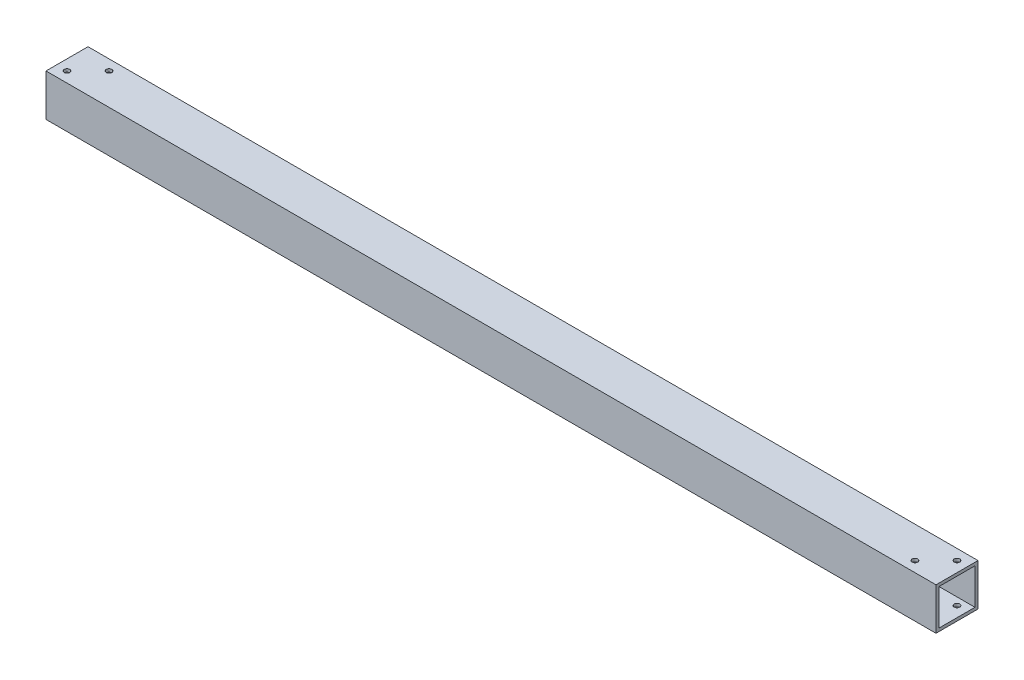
ISO-10303-21;
HEADER;
FILE_DESCRIPTION(('STEP AP214'),'2;1');
FILE_NAME('part.step','',(''),(''),'','','');
FILE_SCHEMA(('AUTOMOTIVE_DESIGN { 1 0 10303 214 1 1 1 1 }'));
ENDSEC;
DATA;
#1=APPLICATION_CONTEXT('core data for automotive mechanical design processes');
#2=APPLICATION_PROTOCOL_DEFINITION('international standard','automotive_design',2000,#1);
#3=PRODUCT_CONTEXT('',#1,'mechanical');
#4=PRODUCT('Part','Part','',(#3));
#5=PRODUCT_RELATED_PRODUCT_CATEGORY('part','',(#4));
#6=PRODUCT_DEFINITION_FORMATION('','',#4);
#7=PRODUCT_DEFINITION_CONTEXT('part definition',#1,'design');
#8=PRODUCT_DEFINITION('design','',#6,#7);
#9=PRODUCT_DEFINITION_SHAPE('','',#8);
#10=(LENGTH_UNIT() NAMED_UNIT(*) SI_UNIT(.MILLI.,.METRE.));
#11=(NAMED_UNIT(*) PLANE_ANGLE_UNIT() SI_UNIT($,.RADIAN.));
#12=(NAMED_UNIT(*) SI_UNIT($,.STERADIAN.) SOLID_ANGLE_UNIT());
#13=UNCERTAINTY_MEASURE_WITH_UNIT(LENGTH_MEASURE(1.E-05),#10,'distance_accuracy_value','');
#14=(GEOMETRIC_REPRESENTATION_CONTEXT(3) GLOBAL_UNCERTAINTY_ASSIGNED_CONTEXT((#13)) GLOBAL_UNIT_ASSIGNED_CONTEXT((#10,
#11,#12)) REPRESENTATION_CONTEXT('',''));
#15=CARTESIAN_POINT('',(0.,0.,0.));
#16=DIRECTION('',(0.,0.,1.));
#17=DIRECTION('',(1.,0.,0.));
#18=AXIS2_PLACEMENT_3D('',#15,#16,#17);
#19=CARTESIAN_POINT('',(1076.198,50.8,0.));
#20=DIRECTION('',(-1.,0.,0.));
#21=DIRECTION('',(0.,0.,1.));
#22=AXIS2_PLACEMENT_3D('',#19,#20,#21);
#23=PLANE('',#22);
#24=DIRECTION('',(0.,-1.,0.));
#25=VECTOR('',#24,1.);
#26=CARTESIAN_POINT('',(1076.198,0.,0.));
#27=LINE('',#26,#25);
#28=CARTESIAN_POINT('',(1076.198,50.8,0.));
#29=VERTEX_POINT('',#28);
#30=CARTESIAN_POINT('',(1076.198,0.,0.));
#31=VERTEX_POINT('',#30);
#32=EDGE_CURVE('E135',#29,#31,#27,.T.);
#33=ORIENTED_EDGE('',*,*,#32,.T.);
#34=DIRECTION('',(0.,0.,-1.));
#35=VECTOR('',#34,1.);
#36=CARTESIAN_POINT('',(1076.198,0.,0.));
#37=LINE('',#36,#35);
#38=CARTESIAN_POINT('',(1076.198,0.,-50.8));
#39=VERTEX_POINT('',#38);
#40=EDGE_CURVE('E138',#31,#39,#37,.T.);
#41=ORIENTED_EDGE('',*,*,#40,.T.);
#42=DIRECTION('',(0.,1.,0.));
#43=VECTOR('',#42,1.);
#44=CARTESIAN_POINT('',(1076.198,0.,-50.8));
#45=LINE('',#44,#43);
#46=CARTESIAN_POINT('',(1076.198,50.8,-50.8));
#47=VERTEX_POINT('',#46);
#48=EDGE_CURVE('E141',#39,#47,#45,.T.);
#49=ORIENTED_EDGE('',*,*,#48,.T.);
#50=DIRECTION('',(0.,0.,1.));
#51=VECTOR('',#50,1.);
#52=CARTESIAN_POINT('',(1076.198,50.8,0.));
#53=LINE('',#52,#51);
#54=EDGE_CURVE('E143',#47,#29,#53,.T.);
#55=ORIENTED_EDGE('',*,*,#54,.T.);
#56=EDGE_LOOP('',(#33,#41,#49,#55));
#57=FACE_BOUND('',#56,.T.);
#58=DIRECTION('',(0.,-1.,0.));
#59=VECTOR('',#58,1.);
#60=CARTESIAN_POINT('',(1076.198,47.1424,-3.6576));
#61=LINE('',#60,#59);
#62=CARTESIAN_POINT('',(1076.198,47.1424,-3.6576));
#63=VERTEX_POINT('',#62);
#64=CARTESIAN_POINT('',(1076.198,3.6576,-3.6576));
#65=VERTEX_POINT('',#64);
#66=EDGE_CURVE('E97',#63,#65,#61,.T.);
#67=ORIENTED_EDGE('',*,*,#66,.F.);
#68=DIRECTION('',(0.,0.,1.));
#69=VECTOR('',#68,1.);
#70=CARTESIAN_POINT('',(1076.198,47.1424,-3.6576));
#71=LINE('',#70,#69);
#72=CARTESIAN_POINT('',(1076.198,47.1424,-47.1424));
#73=VERTEX_POINT('',#72);
#74=EDGE_CURVE('E119',#73,#63,#71,.T.);
#75=ORIENTED_EDGE('',*,*,#74,.F.);
#76=DIRECTION('',(0.,1.,0.));
#77=VECTOR('',#76,1.);
#78=CARTESIAN_POINT('',(1076.198,47.1424,-47.1424));
#79=LINE('',#78,#77);
#80=CARTESIAN_POINT('',(1076.198,3.6576,-47.1424));
#81=VERTEX_POINT('',#80);
#82=EDGE_CURVE('E117',#81,#73,#79,.T.);
#83=ORIENTED_EDGE('',*,*,#82,.F.);
#84=DIRECTION('',(0.,0.,-1.));
#85=VECTOR('',#84,1.);
#86=CARTESIAN_POINT('',(1076.198,3.6576,-3.6576));
#87=LINE('',#86,#85);
#88=EDGE_CURVE('E105',#65,#81,#87,.T.);
#89=ORIENTED_EDGE('',*,*,#88,.F.);
#90=EDGE_LOOP('',(#67,#75,#83,#89));
#91=FACE_BOUND('',#90,.T.);
#92=ADVANCED_FACE('F30',(#57,#91),#23,.F.);
#93=CARTESIAN_POINT('',(0.,50.8,0.));
#94=DIRECTION('',(-1.,0.,0.));
#95=DIRECTION('',(0.,0.,1.));
#96=AXIS2_PLACEMENT_3D('',#93,#94,#95);
#97=PLANE('',#96);
#98=DIRECTION('',(0.,-1.,0.));
#99=VECTOR('',#98,1.);
#100=CARTESIAN_POINT('',(0.,0.,0.));
#101=LINE('',#100,#99);
#102=CARTESIAN_POINT('',(0.,50.8,0.));
#103=VERTEX_POINT('',#102);
#104=CARTESIAN_POINT('',(0.,0.,0.));
#105=VERTEX_POINT('',#104);
#106=EDGE_CURVE('E113',#103,#105,#101,.T.);
#107=ORIENTED_EDGE('',*,*,#106,.F.);
#108=DIRECTION('',(0.,0.,1.));
#109=VECTOR('',#108,1.);
#110=CARTESIAN_POINT('',(0.,50.8,0.));
#111=LINE('',#110,#109);
#112=CARTESIAN_POINT('',(0.,50.8,-50.8));
#113=VERTEX_POINT('',#112);
#114=EDGE_CURVE('E139',#113,#103,#111,.T.);
#115=ORIENTED_EDGE('',*,*,#114,.F.);
#116=DIRECTION('',(0.,1.,0.));
#117=VECTOR('',#116,1.);
#118=CARTESIAN_POINT('',(0.,0.,-50.8));
#119=LINE('',#118,#117);
#120=CARTESIAN_POINT('',(0.,0.,-50.8));
#121=VERTEX_POINT('',#120);
#122=EDGE_CURVE('E150',#121,#113,#119,.T.);
#123=ORIENTED_EDGE('',*,*,#122,.F.);
#124=DIRECTION('',(0.,0.,-1.));
#125=VECTOR('',#124,1.);
#126=CARTESIAN_POINT('',(0.,0.,0.));
#127=LINE('',#126,#125);
#128=EDGE_CURVE('E148',#105,#121,#127,.T.);
#129=ORIENTED_EDGE('',*,*,#128,.F.);
#130=EDGE_LOOP('',(#107,#115,#123,#129));
#131=FACE_BOUND('',#130,.T.);
#132=DIRECTION('',(0.,0.,1.));
#133=VECTOR('',#132,1.);
#134=CARTESIAN_POINT('',(0.,47.1424,-3.6576));
#135=LINE('',#134,#133);
#136=CARTESIAN_POINT('',(0.,47.1424,-47.1424));
#137=VERTEX_POINT('',#136);
#138=CARTESIAN_POINT('',(0.,47.1424,-3.6576));
#139=VERTEX_POINT('',#138);
#140=EDGE_CURVE('E106',#137,#139,#135,.T.);
#141=ORIENTED_EDGE('',*,*,#140,.T.);
#142=DIRECTION('',(0.,-1.,0.));
#143=VECTOR('',#142,1.);
#144=CARTESIAN_POINT('',(0.,47.1424,-3.6576));
#145=LINE('',#144,#143);
#146=CARTESIAN_POINT('',(0.,3.6576,-3.6576));
#147=VERTEX_POINT('',#146);
#148=EDGE_CURVE('E55',#139,#147,#145,.T.);
#149=ORIENTED_EDGE('',*,*,#148,.T.);
#150=DIRECTION('',(0.,0.,-1.));
#151=VECTOR('',#150,1.);
#152=CARTESIAN_POINT('',(0.,3.6576,-3.6576));
#153=LINE('',#152,#151);
#154=CARTESIAN_POINT('',(0.,3.6576,-47.1424));
#155=VERTEX_POINT('',#154);
#156=EDGE_CURVE('E112',#147,#155,#153,.T.);
#157=ORIENTED_EDGE('',*,*,#156,.T.);
#158=DIRECTION('',(0.,1.,0.));
#159=VECTOR('',#158,1.);
#160=CARTESIAN_POINT('',(0.,47.1424,-47.1424));
#161=LINE('',#160,#159);
#162=EDGE_CURVE('E127',#155,#137,#161,.T.);
#163=ORIENTED_EDGE('',*,*,#162,.T.);
#164=EDGE_LOOP('',(#141,#149,#157,#163));
#165=FACE_BOUND('',#164,.T.);
#166=ADVANCED_FACE('F220',(#131,#165),#97,.T.);
#167=CARTESIAN_POINT('',(1076.198,0.,0.));
#168=DIRECTION('',(0.,0.,-1.));
#169=DIRECTION('',(-1.,0.,0.));
#170=AXIS2_PLACEMENT_3D('',#167,#168,#169);
#171=PLANE('',#170);
#172=ORIENTED_EDGE('',*,*,#106,.T.);
#173=DIRECTION('',(-1.,0.,0.));
#174=VECTOR('',#173,1.);
#175=CARTESIAN_POINT('',(1076.198,0.,0.));
#176=LINE('',#175,#174);
#177=EDGE_CURVE('E11',#31,#105,#176,.T.);
#178=ORIENTED_EDGE('',*,*,#177,.F.);
#179=ORIENTED_EDGE('',*,*,#32,.F.);
#180=DIRECTION('',(-1.,0.,0.));
#181=VECTOR('',#180,1.);
#182=CARTESIAN_POINT('',(1076.198,50.8,0.));
#183=LINE('',#182,#181);
#184=EDGE_CURVE('E145',#29,#103,#183,.T.);
#185=ORIENTED_EDGE('',*,*,#184,.T.);
#186=EDGE_LOOP('',(#172,#178,#179,#185));
#187=FACE_BOUND('',#186,.T.);
#188=ADVANCED_FACE('F32',(#187),#171,.F.);
#189=CARTESIAN_POINT('',(1076.198,0.,0.));
#190=DIRECTION('',(0.,1.,0.));
#191=DIRECTION('',(0.,0.,1.));
#192=AXIS2_PLACEMENT_3D('',#189,#190,#191);
#193=PLANE('',#192);
#194=CARTESIAN_POINT('',(1038.098,0.,-12.7));
#195=DIRECTION('',(0.,1.,0.));
#196=DIRECTION('',(0.,0.,1.));
#197=AXIS2_PLACEMENT_3D('',#194,#195,#196);
#198=CIRCLE('',#197,3.37312000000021);
#199=CARTESIAN_POINT('',(1038.098,0.,-9.32687999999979));
#200=VERTEX_POINT('',#199);
#201=EDGE_CURVE('E244',#200,#200,#198,.T.);
#202=ORIENTED_EDGE('',*,*,#201,.T.);
#203=EDGE_LOOP('',(#202));
#204=FACE_BOUND('',#203,.T.);
#205=CARTESIAN_POINT('',(1063.498,0.,-38.1));
#206=DIRECTION('',(0.,1.,0.));
#207=DIRECTION('',(0.,0.,1.));
#208=AXIS2_PLACEMENT_3D('',#205,#206,#207);
#209=CIRCLE('',#208,3.37312000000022);
#210=CARTESIAN_POINT('',(1063.498,0.,-34.7268799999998));
#211=VERTEX_POINT('',#210);
#212=EDGE_CURVE('E171',#211,#211,#209,.T.);
#213=ORIENTED_EDGE('',*,*,#212,.T.);
#214=EDGE_LOOP('',(#213));
#215=FACE_BOUND('',#214,.T.);
#216=CARTESIAN_POINT('',(38.1,0.,-38.1));
#217=DIRECTION('',(0.,1.,0.));
#218=DIRECTION('',(0.,0.,1.));
#219=AXIS2_PLACEMENT_3D('',#216,#217,#218);
#220=CIRCLE('',#219,3.37312);
#221=CARTESIAN_POINT('',(38.1,0.,-34.72688));
#222=VERTEX_POINT('',#221);
#223=EDGE_CURVE('E167',#222,#222,#220,.T.);
#224=ORIENTED_EDGE('',*,*,#223,.T.);
#225=EDGE_LOOP('',(#224));
#226=FACE_BOUND('',#225,.T.);
#227=CARTESIAN_POINT('',(12.7,0.,-12.7));
#228=DIRECTION('',(0.,1.,0.));
#229=DIRECTION('',(0.,0.,1.));
#230=AXIS2_PLACEMENT_3D('',#227,#228,#229);
#231=CIRCLE('',#230,3.37312);
#232=CARTESIAN_POINT('',(12.7,0.,-9.32688));
#233=VERTEX_POINT('',#232);
#234=EDGE_CURVE('E163',#233,#233,#231,.T.);
#235=ORIENTED_EDGE('',*,*,#234,.T.);
#236=EDGE_LOOP('',(#235));
#237=FACE_BOUND('',#236,.T.);
#238=ORIENTED_EDGE('',*,*,#128,.T.);
#239=DIRECTION('',(-1.,0.,0.));
#240=VECTOR('',#239,1.);
#241=CARTESIAN_POINT('',(1076.198,0.,-50.8));
#242=LINE('',#241,#240);
#243=EDGE_CURVE('E39',#39,#121,#242,.T.);
#244=ORIENTED_EDGE('',*,*,#243,.F.);
#245=ORIENTED_EDGE('',*,*,#40,.F.);
#246=ORIENTED_EDGE('',*,*,#177,.T.);
#247=EDGE_LOOP('',(#238,#244,#245,#246));
#248=FACE_BOUND('',#247,.T.);
#249=ADVANCED_FACE('F234',(#204,#215,#226,#237,#248),#193,.F.);
#250=CARTESIAN_POINT('',(1076.198,0.,-50.8));
#251=DIRECTION('',(0.,0.,1.));
#252=DIRECTION('',(1.,0.,0.));
#253=AXIS2_PLACEMENT_3D('',#250,#251,#252);
#254=PLANE('',#253);
#255=ORIENTED_EDGE('',*,*,#122,.T.);
#256=DIRECTION('',(-1.,0.,0.));
#257=VECTOR('',#256,1.);
#258=CARTESIAN_POINT('',(1076.198,50.8,-50.8));
#259=LINE('',#258,#257);
#260=EDGE_CURVE('E155',#47,#113,#259,.T.);
#261=ORIENTED_EDGE('',*,*,#260,.F.);
#262=ORIENTED_EDGE('',*,*,#48,.F.);
#263=ORIENTED_EDGE('',*,*,#243,.T.);
#264=EDGE_LOOP('',(#255,#261,#262,#263));
#265=FACE_BOUND('',#264,.T.);
#266=ADVANCED_FACE('F231',(#265),#254,.F.);
#267=CARTESIAN_POINT('',(1076.198,50.8,0.));
#268=DIRECTION('',(0.,-1.,0.));
#269=DIRECTION('',(0.,0.,-1.));
#270=AXIS2_PLACEMENT_3D('',#267,#268,#269);
#271=PLANE('',#270);
#272=CARTESIAN_POINT('',(1038.098,50.8,-12.7));
#273=DIRECTION('',(0.,1.,0.));
#274=DIRECTION('',(0.,0.,1.));
#275=AXIS2_PLACEMENT_3D('',#272,#273,#274);
#276=CIRCLE('',#275,3.37312000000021);
#277=CARTESIAN_POINT('',(1038.098,50.8,-9.32687999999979));
#278=VERTEX_POINT('',#277);
#279=EDGE_CURVE('E298',#278,#278,#276,.T.);
#280=ORIENTED_EDGE('',*,*,#279,.F.);
#281=EDGE_LOOP('',(#280));
#282=FACE_BOUND('',#281,.T.);
#283=CARTESIAN_POINT('',(1063.498,50.8,-38.1));
#284=DIRECTION('',(0.,1.,0.));
#285=DIRECTION('',(0.,0.,1.));
#286=AXIS2_PLACEMENT_3D('',#283,#284,#285);
#287=CIRCLE('',#286,3.37312000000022);
#288=CARTESIAN_POINT('',(1063.498,50.8,-34.7268799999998));
#289=VERTEX_POINT('',#288);
#290=EDGE_CURVE('E178',#289,#289,#287,.T.);
#291=ORIENTED_EDGE('',*,*,#290,.F.);
#292=EDGE_LOOP('',(#291));
#293=FACE_BOUND('',#292,.T.);
#294=CARTESIAN_POINT('',(38.1,50.8,-38.1));
#295=DIRECTION('',(0.,1.,0.));
#296=DIRECTION('',(0.,0.,1.));
#297=AXIS2_PLACEMENT_3D('',#294,#295,#296);
#298=CIRCLE('',#297,3.37312);
#299=CARTESIAN_POINT('',(38.1,50.8,-34.72688));
#300=VERTEX_POINT('',#299);
#301=EDGE_CURVE('E175',#300,#300,#298,.T.);
#302=ORIENTED_EDGE('',*,*,#301,.F.);
#303=EDGE_LOOP('',(#302));
#304=FACE_BOUND('',#303,.T.);
#305=CARTESIAN_POINT('',(12.7,50.8,-12.7));
#306=DIRECTION('',(0.,1.,0.));
#307=DIRECTION('',(0.,0.,1.));
#308=AXIS2_PLACEMENT_3D('',#305,#306,#307);
#309=CIRCLE('',#308,3.37312);
#310=CARTESIAN_POINT('',(12.7,50.8,-9.32688));
#311=VERTEX_POINT('',#310);
#312=EDGE_CURVE('E194',#311,#311,#309,.T.);
#313=ORIENTED_EDGE('',*,*,#312,.F.);
#314=EDGE_LOOP('',(#313));
#315=FACE_BOUND('',#314,.T.);
#316=ORIENTED_EDGE('',*,*,#114,.T.);
#317=ORIENTED_EDGE('',*,*,#184,.F.);
#318=ORIENTED_EDGE('',*,*,#54,.F.);
#319=ORIENTED_EDGE('',*,*,#260,.T.);
#320=EDGE_LOOP('',(#316,#317,#318,#319));
#321=FACE_BOUND('',#320,.T.);
#322=ADVANCED_FACE('F215',(#282,#293,#304,#315,#321),#271,.F.);
#323=CARTESIAN_POINT('',(1076.198,47.1424,-3.6576));
#324=DIRECTION('',(0.,0.,-1.));
#325=DIRECTION('',(0.,1.,0.));
#326=AXIS2_PLACEMENT_3D('',#323,#324,#325);
#327=PLANE('',#326);
#328=ORIENTED_EDGE('',*,*,#148,.F.);
#329=DIRECTION('',(-1.,0.,0.));
#330=VECTOR('',#329,1.);
#331=CARTESIAN_POINT('',(1076.198,47.1424,-3.6576));
#332=LINE('',#331,#330);
#333=EDGE_CURVE('E101',#63,#139,#332,.T.);
#334=ORIENTED_EDGE('',*,*,#333,.F.);
#335=ORIENTED_EDGE('',*,*,#66,.T.);
#336=DIRECTION('',(-1.,0.,0.));
#337=VECTOR('',#336,1.);
#338=CARTESIAN_POINT('',(1076.198,3.6576,-3.6576));
#339=LINE('',#338,#337);
#340=EDGE_CURVE('E100',#65,#147,#339,.T.);
#341=ORIENTED_EDGE('',*,*,#340,.T.);
#342=EDGE_LOOP('',(#328,#334,#335,#341));
#343=FACE_BOUND('',#342,.T.);
#344=ADVANCED_FACE('F99',(#343),#327,.T.);
#345=CARTESIAN_POINT('',(1076.198,3.6576,-3.6576));
#346=DIRECTION('',(0.,1.,0.));
#347=DIRECTION('',(0.,0.,1.));
#348=AXIS2_PLACEMENT_3D('',#345,#346,#347);
#349=PLANE('',#348);
#350=CARTESIAN_POINT('',(1038.098,3.6576,-12.7));
#351=DIRECTION('',(0.,1.,0.));
#352=DIRECTION('',(0.,0.,1.));
#353=AXIS2_PLACEMENT_3D('',#350,#351,#352);
#354=CIRCLE('',#353,3.37312000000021);
#355=CARTESIAN_POINT('',(1038.098,3.6576,-9.32687999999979));
#356=VERTEX_POINT('',#355);
#357=EDGE_CURVE('E183',#356,#356,#354,.T.);
#358=ORIENTED_EDGE('',*,*,#357,.F.);
#359=EDGE_LOOP('',(#358));
#360=FACE_BOUND('',#359,.T.);
#361=CARTESIAN_POINT('',(1063.498,3.6576,-38.1));
#362=DIRECTION('',(0.,1.,0.));
#363=DIRECTION('',(0.,0.,1.));
#364=AXIS2_PLACEMENT_3D('',#361,#362,#363);
#365=CIRCLE('',#364,3.37312000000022);
#366=CARTESIAN_POINT('',(1063.498,3.6576,-34.7268799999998));
#367=VERTEX_POINT('',#366);
#368=EDGE_CURVE('E170',#367,#367,#365,.T.);
#369=ORIENTED_EDGE('',*,*,#368,.F.);
#370=EDGE_LOOP('',(#369));
#371=FACE_BOUND('',#370,.T.);
#372=CARTESIAN_POINT('',(38.1,3.6576,-38.1));
#373=DIRECTION('',(0.,1.,0.));
#374=DIRECTION('',(0.,0.,1.));
#375=AXIS2_PLACEMENT_3D('',#372,#373,#374);
#376=CIRCLE('',#375,3.37312);
#377=CARTESIAN_POINT('',(38.1,3.6576,-34.72688));
#378=VERTEX_POINT('',#377);
#379=EDGE_CURVE('E166',#378,#378,#376,.T.);
#380=ORIENTED_EDGE('',*,*,#379,.F.);
#381=EDGE_LOOP('',(#380));
#382=FACE_BOUND('',#381,.T.);
#383=CARTESIAN_POINT('',(12.7,3.6576,-12.7));
#384=DIRECTION('',(0.,1.,0.));
#385=DIRECTION('',(0.,0.,1.));
#386=AXIS2_PLACEMENT_3D('',#383,#384,#385);
#387=CIRCLE('',#386,3.37312);
#388=CARTESIAN_POINT('',(12.7,3.6576,-9.32688));
#389=VERTEX_POINT('',#388);
#390=EDGE_CURVE('E125',#389,#389,#387,.T.);
#391=ORIENTED_EDGE('',*,*,#390,.F.);
#392=EDGE_LOOP('',(#391));
#393=FACE_BOUND('',#392,.T.);
#394=ORIENTED_EDGE('',*,*,#156,.F.);
#395=ORIENTED_EDGE('',*,*,#340,.F.);
#396=ORIENTED_EDGE('',*,*,#88,.T.);
#397=DIRECTION('',(-1.,0.,0.));
#398=VECTOR('',#397,1.);
#399=CARTESIAN_POINT('',(1076.198,3.6576,-47.1424));
#400=LINE('',#399,#398);
#401=EDGE_CURVE('E114',#81,#155,#400,.T.);
#402=ORIENTED_EDGE('',*,*,#401,.T.);
#403=EDGE_LOOP('',(#394,#395,#396,#402));
#404=FACE_BOUND('',#403,.T.);
#405=ADVANCED_FACE('F109',(#360,#371,#382,#393,#404),#349,.T.);
#406=CARTESIAN_POINT('',(1076.198,47.1424,-47.1424));
#407=DIRECTION('',(0.,0.,1.));
#408=DIRECTION('',(0.,-1.,0.));
#409=AXIS2_PLACEMENT_3D('',#406,#407,#408);
#410=PLANE('',#409);
#411=ORIENTED_EDGE('',*,*,#162,.F.);
#412=ORIENTED_EDGE('',*,*,#401,.F.);
#413=ORIENTED_EDGE('',*,*,#82,.T.);
#414=DIRECTION('',(-1.,0.,0.));
#415=VECTOR('',#414,1.);
#416=CARTESIAN_POINT('',(1076.198,47.1424,-47.1424));
#417=LINE('',#416,#415);
#418=EDGE_CURVE('E47',#73,#137,#417,.T.);
#419=ORIENTED_EDGE('',*,*,#418,.T.);
#420=EDGE_LOOP('',(#411,#412,#413,#419));
#421=FACE_BOUND('',#420,.T.);
#422=ADVANCED_FACE('F205',(#421),#410,.T.);
#423=CARTESIAN_POINT('',(1076.198,47.1424,-3.6576));
#424=DIRECTION('',(0.,-1.,0.));
#425=DIRECTION('',(0.,0.,-1.));
#426=AXIS2_PLACEMENT_3D('',#423,#424,#425);
#427=PLANE('',#426);
#428=CARTESIAN_POINT('',(1038.098,47.1424,-12.7));
#429=DIRECTION('',(0.,-1.,0.));
#430=DIRECTION('',(0.,0.,-1.));
#431=AXIS2_PLACEMENT_3D('',#428,#429,#430);
#432=CIRCLE('',#431,3.37312000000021);
#433=CARTESIAN_POINT('',(1038.098,47.1424,-16.0731200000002));
#434=VERTEX_POINT('',#433);
#435=EDGE_CURVE('E34',#434,#434,#432,.T.);
#436=ORIENTED_EDGE('',*,*,#435,.F.);
#437=EDGE_LOOP('',(#436));
#438=FACE_BOUND('',#437,.T.);
#439=CARTESIAN_POINT('',(1063.498,47.1424,-38.1));
#440=DIRECTION('',(0.,-1.,0.));
#441=DIRECTION('',(0.,0.,-1.));
#442=AXIS2_PLACEMENT_3D('',#439,#440,#441);
#443=CIRCLE('',#442,3.37312000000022);
#444=CARTESIAN_POINT('',(1063.498,47.1424,-41.4731200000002));
#445=VERTEX_POINT('',#444);
#446=EDGE_CURVE('E168',#445,#445,#443,.T.);
#447=ORIENTED_EDGE('',*,*,#446,.F.);
#448=EDGE_LOOP('',(#447));
#449=FACE_BOUND('',#448,.T.);
#450=CARTESIAN_POINT('',(38.1,47.1424,-38.1));
#451=DIRECTION('',(0.,-1.,0.));
#452=DIRECTION('',(0.,0.,-1.));
#453=AXIS2_PLACEMENT_3D('',#450,#451,#452);
#454=CIRCLE('',#453,3.37312);
#455=CARTESIAN_POINT('',(38.1,47.1424,-41.47312));
#456=VERTEX_POINT('',#455);
#457=EDGE_CURVE('E164',#456,#456,#454,.T.);
#458=ORIENTED_EDGE('',*,*,#457,.F.);
#459=EDGE_LOOP('',(#458));
#460=FACE_BOUND('',#459,.T.);
#461=CARTESIAN_POINT('',(12.7,47.1424,-12.7));
#462=DIRECTION('',(0.,-1.,0.));
#463=DIRECTION('',(0.,0.,-1.));
#464=AXIS2_PLACEMENT_3D('',#461,#462,#463);
#465=CIRCLE('',#464,3.37312);
#466=CARTESIAN_POINT('',(12.7,47.1424,-16.07312));
#467=VERTEX_POINT('',#466);
#468=EDGE_CURVE('E160',#467,#467,#465,.T.);
#469=ORIENTED_EDGE('',*,*,#468,.F.);
#470=EDGE_LOOP('',(#469));
#471=FACE_BOUND('',#470,.T.);
#472=ORIENTED_EDGE('',*,*,#140,.F.);
#473=ORIENTED_EDGE('',*,*,#418,.F.);
#474=ORIENTED_EDGE('',*,*,#74,.T.);
#475=ORIENTED_EDGE('',*,*,#333,.T.);
#476=EDGE_LOOP('',(#472,#473,#474,#475));
#477=FACE_BOUND('',#476,.T.);
#478=ADVANCED_FACE('F212',(#438,#449,#460,#471,#477),#427,.T.);
#479=CARTESIAN_POINT('',(12.7,0.,-12.7));
#480=DIRECTION('',(0.,1.,0.));
#481=DIRECTION('',(0.,0.,1.));
#482=AXIS2_PLACEMENT_3D('',#479,#480,#481);
#483=CYLINDRICAL_SURFACE('',#482,3.37312);
#484=ORIENTED_EDGE('',*,*,#468,.T.);
#485=EDGE_LOOP('',(#484));
#486=FACE_BOUND('',#485,.T.);
#487=ORIENTED_EDGE('',*,*,#312,.T.);
#488=EDGE_LOOP('',(#487));
#489=FACE_BOUND('',#488,.T.);
#490=ADVANCED_FACE('F264',(#486,#489),#483,.F.);
#491=ORIENTED_EDGE('',*,*,#390,.T.);
#492=EDGE_LOOP('',(#491));
#493=FACE_BOUND('',#492,.T.);
#494=ORIENTED_EDGE('',*,*,#234,.F.);
#495=EDGE_LOOP('',(#494));
#496=FACE_BOUND('',#495,.T.);
#497=ADVANCED_FACE('F201',(#493,#496),#483,.F.);
#498=CARTESIAN_POINT('',(38.1,0.,-38.1));
#499=DIRECTION('',(0.,1.,0.));
#500=DIRECTION('',(0.,0.,1.));
#501=AXIS2_PLACEMENT_3D('',#498,#499,#500);
#502=CYLINDRICAL_SURFACE('',#501,3.37312);
#503=ORIENTED_EDGE('',*,*,#457,.T.);
#504=EDGE_LOOP('',(#503));
#505=FACE_BOUND('',#504,.T.);
#506=ORIENTED_EDGE('',*,*,#301,.T.);
#507=EDGE_LOOP('',(#506));
#508=FACE_BOUND('',#507,.T.);
#509=ADVANCED_FACE('F275',(#505,#508),#502,.F.);
#510=ORIENTED_EDGE('',*,*,#379,.T.);
#511=EDGE_LOOP('',(#510));
#512=FACE_BOUND('',#511,.T.);
#513=ORIENTED_EDGE('',*,*,#223,.F.);
#514=EDGE_LOOP('',(#513));
#515=FACE_BOUND('',#514,.T.);
#516=ADVANCED_FACE('F278',(#512,#515),#502,.F.);
#517=CARTESIAN_POINT('',(1063.498,0.,-38.1));
#518=DIRECTION('',(0.,1.,0.));
#519=DIRECTION('',(0.,0.,1.));
#520=AXIS2_PLACEMENT_3D('',#517,#518,#519);
#521=CYLINDRICAL_SURFACE('',#520,3.37312000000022);
#522=ORIENTED_EDGE('',*,*,#446,.T.);
#523=EDGE_LOOP('',(#522));
#524=FACE_BOUND('',#523,.T.);
#525=ORIENTED_EDGE('',*,*,#290,.T.);
#526=EDGE_LOOP('',(#525));
#527=FACE_BOUND('',#526,.T.);
#528=ADVANCED_FACE('F280',(#524,#527),#521,.F.);
#529=ORIENTED_EDGE('',*,*,#368,.T.);
#530=EDGE_LOOP('',(#529));
#531=FACE_BOUND('',#530,.T.);
#532=ORIENTED_EDGE('',*,*,#212,.F.);
#533=EDGE_LOOP('',(#532));
#534=FACE_BOUND('',#533,.T.);
#535=ADVANCED_FACE('F283',(#531,#534),#521,.F.);
#536=CARTESIAN_POINT('',(1038.098,0.,-12.7));
#537=DIRECTION('',(0.,1.,0.));
#538=DIRECTION('',(0.,0.,1.));
#539=AXIS2_PLACEMENT_3D('',#536,#537,#538);
#540=CYLINDRICAL_SURFACE('',#539,3.37312000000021);
#541=ORIENTED_EDGE('',*,*,#435,.T.);
#542=EDGE_LOOP('',(#541));
#543=FACE_BOUND('',#542,.T.);
#544=ORIENTED_EDGE('',*,*,#279,.T.);
#545=EDGE_LOOP('',(#544));
#546=FACE_BOUND('',#545,.T.);
#547=ADVANCED_FACE('F284',(#543,#546),#540,.F.);
#548=ORIENTED_EDGE('',*,*,#357,.T.);
#549=EDGE_LOOP('',(#548));
#550=FACE_BOUND('',#549,.T.);
#551=ORIENTED_EDGE('',*,*,#201,.F.);
#552=EDGE_LOOP('',(#551));
#553=FACE_BOUND('',#552,.T.);
#554=ADVANCED_FACE('F286',(#550,#553),#540,.F.);
#555=CLOSED_SHELL('',(#92,#166,#188,#249,#266,#322,#344,#405,#422,#478,#490,#497,#509,#516,#528,
#535,#547,#554));
#556=MANIFOLD_SOLID_BREP('B2',#555);
#557=ADVANCED_BREP_SHAPE_REPRESENTATION('',(#18,#556),#14);
#558=SHAPE_DEFINITION_REPRESENTATION(#9,#557);
ENDSEC;
END-ISO-10303-21;
